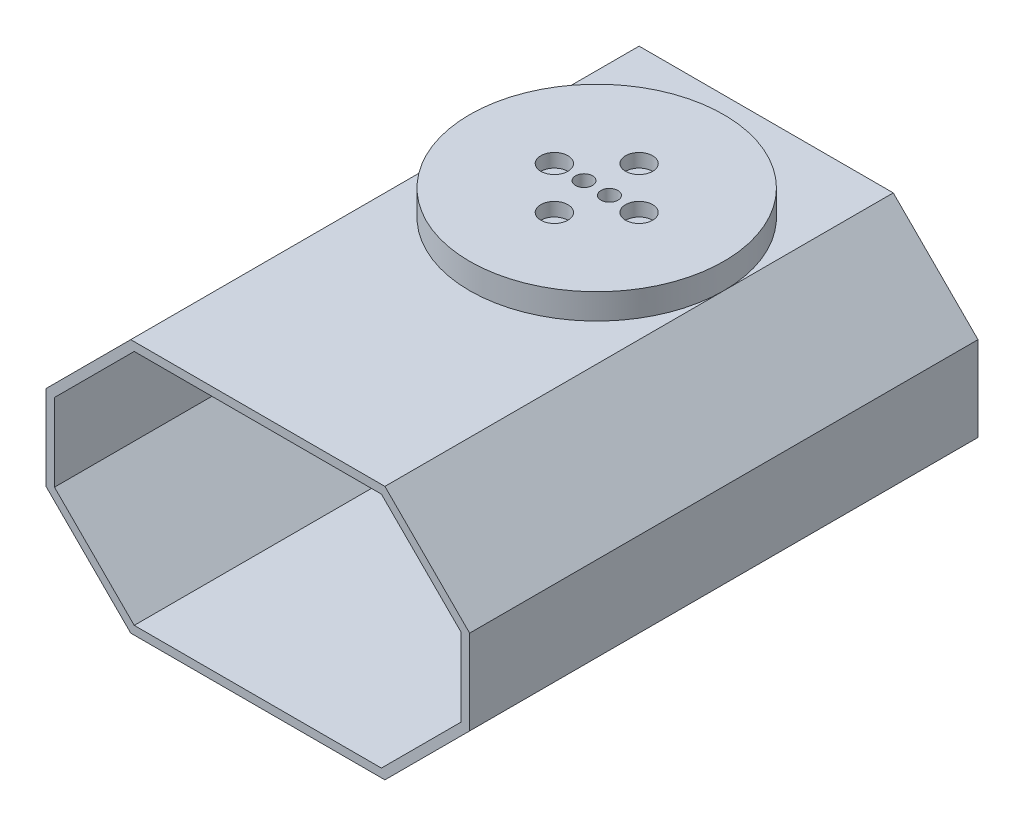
from build123d import *

# Parameters (mm, degrees)
IZIM1_W                     = 50
IZIM1_H                     = 30
Y_KSEKLIK_EKSTR_ZYON1_DEPTH = 60
PAH1_SIZE                   = 10
KES_EKSTR_ZYON1_DEPTH       = 58
IZIM3_R                     = 15
Y_KSEKLIK_EKSTR_ZYON2_DEPTH = 3
IZIM4_R                     = 1
KES_EKSTR_ZYON2_DEPTH       = 8
IZIM5_R                     = 1.6
KES_EKSTR_ZYON3_DEPTH       = 1.6
IZIM6_W                     = 6
IZIM6_H                     = 10.9
KES_EKSTR_ZYON4_DEPTH       = 11.6
IZIM6_3_R                   = 2.5
IZIM6_3_R_2                 = 1
KES_EKSTR_ZYON5_DEPTH       = 0.8


with BuildPart() as part:
    # izim1 → Y_kseklik-Ekstr_zyon1 (new body)
    with BuildSketch(Plane.XY):
        Rectangle(IZIM1_W, IZIM1_H)
    extrude(amount=Y_KSEKLIK_EKSTR_ZYON1_DEPTH)

    # Pah1
    pah1_edges = [part.edges().sort_by_distance(p)[0] for p in [
        (25, -15, 30),
        (-25, -15, 30),
        (-25, 15, 30),
        (25, 15, 30),
    ]]
    chamfer(pah1_edges, length=PAH1_SIZE)

    # izim2 → Kes-Ekstr_zyon1 (cut)
    with BuildSketch(Plane.XY.offset(60)):
        Polygon((-14.585786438, 14), (14.585786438, 14), (24, 4.585786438), (24, -4.585786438), (14.585786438, -14), (-14.585786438, -14), (-24, -4.585786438), (-24, 4.585786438), align=None)
    extrude(amount=-KES_EKSTR_ZYON1_DEPTH, mode=Mode.SUBTRACT)

    # izim3 → Y_kseklik-Ekstr_zyon2 (add)
    with BuildSketch(Plane(origin=(0, 15, 0), x_dir=(1, 0, 0), z_dir=(0, 1, 0))):
        with Locations(Location((0, -20, 0), (0, 0, 180))):
            Circle(IZIM3_R)
    extrude(amount=Y_KSEKLIK_EKSTR_ZYON2_DEPTH)

    # izim4 → Kes-Ekstr_zyon2 (cut)
    with BuildSketch(Plane(origin=(0, 18, 0), x_dir=(1, 0, 0), z_dir=(0, 1, 0))):
        with Locations(Location((-1.5, -20, 0), (0, 0, 270))):
            Circle(IZIM4_R)
        with Locations(Location((1.5, -20, 0), (0, 0, 270))):
            Circle(IZIM4_R)
    extrude(amount=-KES_EKSTR_ZYON2_DEPTH, mode=Mode.SUBTRACT)

    # izim5 → Kes-Ekstr_zyon3 (cut)
    with BuildSketch(Plane(origin=(0, 18, 0), x_dir=(1, 0, 0), z_dir=(0, 1, 0))):
        with Locations(Location((0, -15, 0), (0, 0, 270))):
            Circle(IZIM5_R)
        with Locations(Location((5, -20, 0), (0, 0, 270))):
            Circle(IZIM5_R)
        with Locations(Location((0, -25, 0), (0, 0, 270))):
            Circle(IZIM5_R)
        with Locations(Location((-5, -20, 0), (0, 0, 270))):
            Circle(IZIM5_R)
    extrude(amount=-KES_EKSTR_ZYON3_DEPTH, mode=Mode.SUBTRACT)

    # izim6 → Kes-Ekstr_zyon4 (cut)
    with BuildSketch(Plane(origin=(0, 0, 0), x_dir=(-1, 0, 0), z_dir=(0, 0, -1))):
        Rectangle(IZIM6_W, IZIM6_H)
    extrude(amount=-KES_EKSTR_ZYON4_DEPTH, mode=Mode.SUBTRACT)

    # izim6_3 → Kes-Ekstr_zyon5 (cut)
    # profile 1 of 2: a face of its own
    with BuildSketch(Plane(origin=(0, 0, 0), x_dir=(-1, 0, 0), z_dir=(0, 0, -1))):
        with Locations((0, 10)):
            Circle(IZIM6_3_R)
        with Locations((0.883883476, 9.116116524)):
            Circle(IZIM6_3_R_2, mode=Mode.SUBTRACT)
        with Locations((-0.883883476, 10.883883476)):
            Circle(IZIM6_3_R_2, mode=Mode.SUBTRACT)
    # profile 2 of 2: a face of its own
    with BuildSketch(Plane(origin=(0, 0, 0), x_dir=(-1, 0, 0), z_dir=(0, 0, -1))):
        with Locations((0, -10)):
            Circle(IZIM6_3_R)
        with Locations((0, -10)):
            Circle(IZIM6_3_R_2, mode=Mode.SUBTRACT)
    extrude(amount=-KES_EKSTR_ZYON5_DEPTH, mode=Mode.SUBTRACT)


solid = part.part
